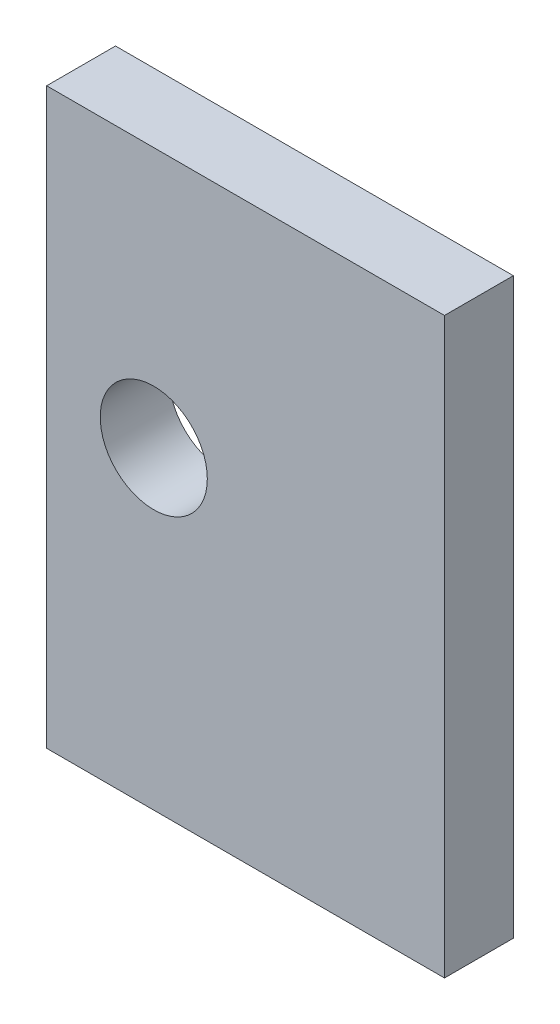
from build123d import *

# Parameters (mm, degrees)
ESQUISSE1_W             = 9
ESQUISSE1_H             = 75
BASE_DEPTH              = 26
ESQUISSE2_R             = 7
ENL_V_MAT_EXTRU_1_DEPTH = 9


with BuildPart() as part:
    # Esquisse1 → BASE (new, symmetric)
    with BuildSketch(Plane(origin=(0, 0, 0), x_dir=(0, 0, -1), z_dir=(1, 0, 0))):
        with Locations((4.5, 22.5)):
            Rectangle(ESQUISSE1_W, ESQUISSE1_H)
    extrude(amount=BASE_DEPTH, both=True)

    # Esquisse2 → Enl_v. mat.-Extru.1 (cut)
    with BuildSketch(Plane.XY):
        with Locations((-12, 26)):
            Circle(ESQUISSE2_R)
    extrude(amount=-ENL_V_MAT_EXTRU_1_DEPTH, mode=Mode.SUBTRACT)


solid = part.part
